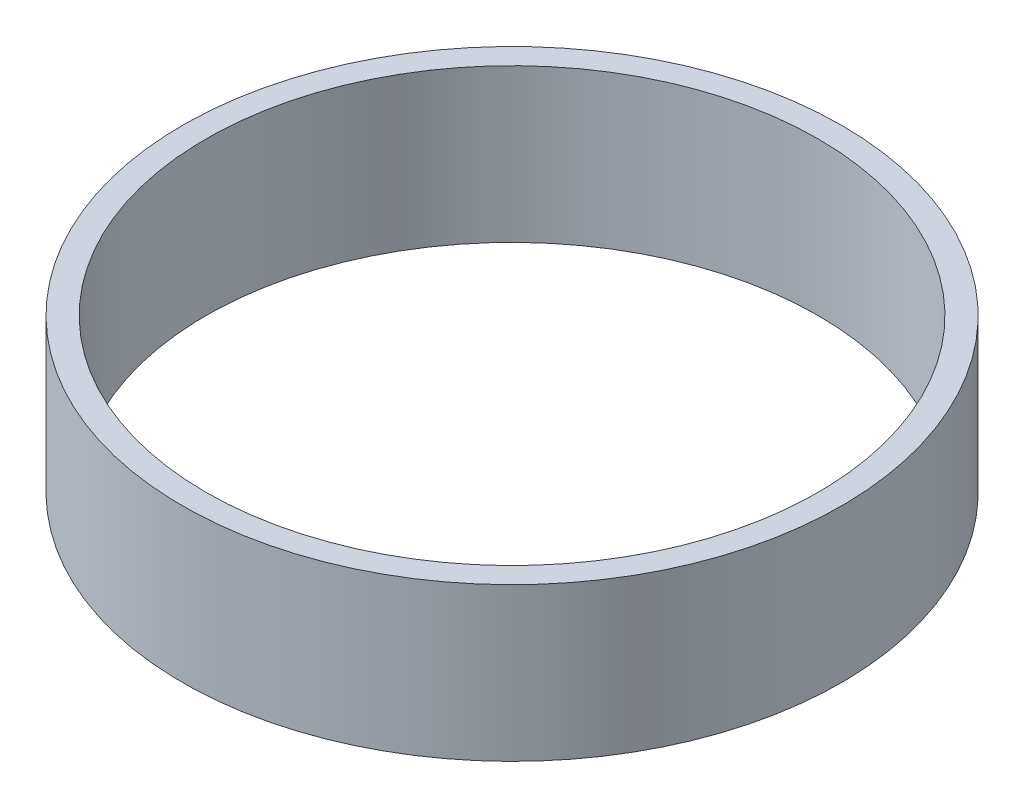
ISO-10303-21;
HEADER;
FILE_DESCRIPTION(('STEP AP214'),'2;1');
FILE_NAME('part.step','',(''),(''),'','','');
FILE_SCHEMA(('AUTOMOTIVE_DESIGN { 1 0 10303 214 1 1 1 1 }'));
ENDSEC;
DATA;
#1=APPLICATION_CONTEXT('core data for automotive mechanical design processes');
#2=APPLICATION_PROTOCOL_DEFINITION('international standard','automotive_design',2000,#1);
#3=PRODUCT_CONTEXT('',#1,'mechanical');
#4=PRODUCT('Part','Part','',(#3));
#5=PRODUCT_RELATED_PRODUCT_CATEGORY('part','',(#4));
#6=PRODUCT_DEFINITION_FORMATION('','',#4);
#7=PRODUCT_DEFINITION_CONTEXT('part definition',#1,'design');
#8=PRODUCT_DEFINITION('design','',#6,#7);
#9=PRODUCT_DEFINITION_SHAPE('','',#8);
#10=(LENGTH_UNIT() NAMED_UNIT(*) SI_UNIT(.MILLI.,.METRE.));
#11=(NAMED_UNIT(*) PLANE_ANGLE_UNIT() SI_UNIT($,.RADIAN.));
#12=(NAMED_UNIT(*) SI_UNIT($,.STERADIAN.) SOLID_ANGLE_UNIT());
#13=UNCERTAINTY_MEASURE_WITH_UNIT(LENGTH_MEASURE(1.E-05),#10,'distance_accuracy_value','');
#14=(GEOMETRIC_REPRESENTATION_CONTEXT(3) GLOBAL_UNCERTAINTY_ASSIGNED_CONTEXT((#13)) GLOBAL_UNIT_ASSIGNED_CONTEXT((#10,
#11,#12)) REPRESENTATION_CONTEXT('',''));
#15=CARTESIAN_POINT('',(0.,0.,0.));
#16=DIRECTION('',(0.,0.,1.));
#17=DIRECTION('',(1.,0.,0.));
#18=AXIS2_PLACEMENT_3D('',#15,#16,#17);
#19=CARTESIAN_POINT('',(0.,9.525,0.));
#20=DIRECTION('',(0.,1.,0.));
#21=DIRECTION('',(0.,0.,1.));
#22=AXIS2_PLACEMENT_3D('',#19,#20,#21);
#23=PLANE('',#22);
#24=CARTESIAN_POINT('',(0.,9.525,0.));
#25=DIRECTION('',(0.,1.,0.));
#26=DIRECTION('',(0.,0.,1.));
#27=AXIS2_PLACEMENT_3D('',#24,#25,#26);
#28=CIRCLE('',#27,20.5105);
#29=CARTESIAN_POINT('',(0.,9.525,-20.5105));
#30=VERTEX_POINT('',#29);
#31=EDGE_CURVE('E10',#30,#30,#28,.T.);
#32=ORIENTED_EDGE('',*,*,#31,.T.);
#33=EDGE_LOOP('',(#32));
#34=FACE_BOUND('',#33,.T.);
#35=CARTESIAN_POINT('',(0.,9.525,0.));
#36=DIRECTION('',(0.,1.,0.));
#37=DIRECTION('',(0.,0.,1.));
#38=AXIS2_PLACEMENT_3D('',#35,#36,#37);
#39=CIRCLE('',#38,19.05);
#40=CARTESIAN_POINT('',(0.,9.525,-19.05));
#41=VERTEX_POINT('',#40);
#42=EDGE_CURVE('E41',#41,#41,#39,.T.);
#43=ORIENTED_EDGE('',*,*,#42,.F.);
#44=EDGE_LOOP('',(#43));
#45=FACE_BOUND('',#44,.T.);
#46=ADVANCED_FACE('F30',(#34,#45),#23,.T.);
#47=CARTESIAN_POINT('',(0.,0.,0.));
#48=DIRECTION('',(0.,1.,0.));
#49=DIRECTION('',(0.,0.,1.));
#50=AXIS2_PLACEMENT_3D('',#47,#48,#49);
#51=PLANE('',#50);
#52=CARTESIAN_POINT('',(0.,0.,0.));
#53=DIRECTION('',(0.,1.,0.));
#54=DIRECTION('',(0.,0.,1.));
#55=AXIS2_PLACEMENT_3D('',#52,#53,#54);
#56=CIRCLE('',#55,20.5105);
#57=CARTESIAN_POINT('',(0.,0.,-20.5105));
#58=VERTEX_POINT('',#57);
#59=EDGE_CURVE('E34',#58,#58,#56,.T.);
#60=ORIENTED_EDGE('',*,*,#59,.F.);
#61=EDGE_LOOP('',(#60));
#62=FACE_BOUND('',#61,.T.);
#63=CARTESIAN_POINT('',(0.,0.,0.));
#64=DIRECTION('',(0.,1.,0.));
#65=DIRECTION('',(0.,0.,1.));
#66=AXIS2_PLACEMENT_3D('',#63,#64,#65);
#67=CIRCLE('',#66,19.05);
#68=CARTESIAN_POINT('',(0.,0.,-19.05));
#69=VERTEX_POINT('',#68);
#70=EDGE_CURVE('E43',#69,#69,#67,.T.);
#71=ORIENTED_EDGE('',*,*,#70,.T.);
#72=EDGE_LOOP('',(#71));
#73=FACE_BOUND('',#72,.T.);
#74=ADVANCED_FACE('F53',(#62,#73),#51,.F.);
#75=CARTESIAN_POINT('',(0.,9.525,0.));
#76=DIRECTION('',(0.,-1.,0.));
#77=DIRECTION('',(0.,0.,-1.));
#78=AXIS2_PLACEMENT_3D('',#75,#76,#77);
#79=CYLINDRICAL_SURFACE('',#78,20.5105);
#80=CARTESIAN_POINT('',(0.,9.525,-20.5105));
#81=CARTESIAN_POINT('',(0.,9.42578125,-20.5105));
#82=CARTESIAN_POINT('',(0.,9.3265625,-20.5105));
#83=CARTESIAN_POINT('',(0.,9.128125,-20.5105));
#84=CARTESIAN_POINT('',(0.,9.02890625,-20.5105));
#85=CARTESIAN_POINT('',(0.,8.83046875,-20.5105));
#86=CARTESIAN_POINT('',(0.,8.73125,-20.5105));
#87=CARTESIAN_POINT('',(0.,8.5328125,-20.5105));
#88=CARTESIAN_POINT('',(0.,8.43359375,-20.5105));
#89=CARTESIAN_POINT('',(0.,8.23515625,-20.5105));
#90=CARTESIAN_POINT('',(0.,8.1359375,-20.5105));
#91=CARTESIAN_POINT('',(0.,7.9375,-20.5105));
#92=CARTESIAN_POINT('',(0.,7.83828125,-20.5105));
#93=CARTESIAN_POINT('',(0.,7.63984375,-20.5105));
#94=CARTESIAN_POINT('',(0.,7.540625,-20.5105));
#95=CARTESIAN_POINT('',(0.,7.3421875,-20.5105));
#96=CARTESIAN_POINT('',(0.,7.24296875,-20.5105));
#97=CARTESIAN_POINT('',(0.,7.04453125,-20.5105));
#98=CARTESIAN_POINT('',(0.,6.9453125,-20.5105));
#99=CARTESIAN_POINT('',(0.,6.746875,-20.5105));
#100=CARTESIAN_POINT('',(0.,6.64765625,-20.5105));
#101=CARTESIAN_POINT('',(0.,6.44921875,-20.5105));
#102=CARTESIAN_POINT('',(0.,6.35,-20.5105));
#103=CARTESIAN_POINT('',(0.,6.1515625,-20.5105));
#104=CARTESIAN_POINT('',(0.,6.05234375,-20.5105));
#105=CARTESIAN_POINT('',(0.,5.85390625,-20.5105));
#106=CARTESIAN_POINT('',(0.,5.7546875,-20.5105));
#107=CARTESIAN_POINT('',(0.,5.55625,-20.5105));
#108=CARTESIAN_POINT('',(0.,5.45703125,-20.5105));
#109=CARTESIAN_POINT('',(0.,5.25859375,-20.5105));
#110=CARTESIAN_POINT('',(0.,5.159375,-20.5105));
#111=CARTESIAN_POINT('',(0.,4.9609375,-20.5105));
#112=CARTESIAN_POINT('',(0.,4.86171875,-20.5105));
#113=CARTESIAN_POINT('',(0.,4.66328125,-20.5105));
#114=CARTESIAN_POINT('',(0.,4.5640625,-20.5105));
#115=CARTESIAN_POINT('',(0.,4.365625,-20.5105));
#116=CARTESIAN_POINT('',(0.,4.26640625,-20.5105));
#117=CARTESIAN_POINT('',(0.,4.06796875,-20.5105));
#118=CARTESIAN_POINT('',(0.,3.96875,-20.5105));
#119=CARTESIAN_POINT('',(0.,3.7703125,-20.5105));
#120=CARTESIAN_POINT('',(0.,3.67109375,-20.5105));
#121=CARTESIAN_POINT('',(0.,3.47265625,-20.5105));
#122=CARTESIAN_POINT('',(0.,3.3734375,-20.5105));
#123=CARTESIAN_POINT('',(0.,3.175,-20.5105));
#124=CARTESIAN_POINT('',(0.,3.07578125,-20.5105));
#125=CARTESIAN_POINT('',(0.,2.87734375,-20.5105));
#126=CARTESIAN_POINT('',(0.,2.778125,-20.5105));
#127=CARTESIAN_POINT('',(0.,2.5796875,-20.5105));
#128=CARTESIAN_POINT('',(0.,2.48046875,-20.5105));
#129=CARTESIAN_POINT('',(0.,2.28203125,-20.5105));
#130=CARTESIAN_POINT('',(0.,2.1828125,-20.5105));
#131=CARTESIAN_POINT('',(0.,1.984375,-20.5105));
#132=CARTESIAN_POINT('',(0.,1.88515625,-20.5105));
#133=CARTESIAN_POINT('',(0.,1.68671875,-20.5105));
#134=CARTESIAN_POINT('',(0.,1.5875,-20.5105));
#135=CARTESIAN_POINT('',(0.,1.3890625,-20.5105));
#136=CARTESIAN_POINT('',(0.,1.28984375,-20.5105));
#137=CARTESIAN_POINT('',(0.,1.09140625,-20.5105));
#138=CARTESIAN_POINT('',(0.,0.992187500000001,-20.5105));
#139=CARTESIAN_POINT('',(0.,0.793750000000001,-20.5105));
#140=CARTESIAN_POINT('',(0.,0.69453125,-20.5105));
#141=CARTESIAN_POINT('',(0.,0.49609375,-20.5105));
#142=CARTESIAN_POINT('',(0.,0.396875,-20.5105));
#143=CARTESIAN_POINT('',(0.,0.1984375,-20.5105));
#144=CARTESIAN_POINT('',(0.,0.0992187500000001,-20.5105));
#145=CARTESIAN_POINT('',(0.,0.,-20.5105));
#146=B_SPLINE_CURVE_WITH_KNOTS('',3,(#80,#81,#82,#83,#84,#85,#86,#87,#88,#89,#90,#91,#92,#93,
#94,#95,#96,#97,#98,#99,#100,#101,#102,#103,#104,#105,#106,#107,#108,#109,#110,#111,#112,#113,
#114,#115,#116,#117,#118,#119,#120,#121,#122,#123,#124,#125,#126,#127,#128,#129,#130,#131,#132,
#133,#134,#135,#136,#137,#138,#139,#140,#141,#142,#143,#144,#145),.UNSPECIFIED.,.F.,.F.,(4,2,2,
2,2,2,2,2,2,2,2,2,2,2,2,2,2,2,2,2,2,2,2,2,2,2,2,2,2,2,2,2,4),(0.,0.29765625,0.5953125,
0.892968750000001,1.190625,1.48828125,1.7859375,2.08359375,2.38125,2.67890625,2.9765625,
3.27421875,3.571875,3.86953125,4.1671875,4.46484375,4.7625,5.06015625,5.3578125,5.65546875,
5.953125,6.25078125,6.5484375,6.84609375,7.14375,7.44140625,7.7390625,8.03671875,8.334375,
8.63203125,8.9296875,9.22734375,9.525),.UNSPECIFIED.);
#147=EDGE_CURVE('BSEAM32',#30,#58,#146,.T.);
#148=ORIENTED_EDGE('',*,*,#31,.F.);
#149=ORIENTED_EDGE('',*,*,#59,.T.);
#150=ORIENTED_EDGE('',*,*,#147,.T.);
#151=ORIENTED_EDGE('',*,*,#147,.F.);
#152=EDGE_LOOP('',(#148,#150,#149,#151));
#153=FACE_BOUND('',#152,.T.);
#154=ADVANCED_FACE('F32',(#153),#79,.T.);
#155=CARTESIAN_POINT('',(0.,9.525,0.));
#156=DIRECTION('',(0.,-1.,0.));
#157=DIRECTION('',(0.,0.,-1.));
#158=AXIS2_PLACEMENT_3D('',#155,#156,#157);
#159=CYLINDRICAL_SURFACE('',#158,19.05);
#160=CARTESIAN_POINT('',(0.,9.525,-19.05));
#161=CARTESIAN_POINT('',(0.,9.42578125,-19.05));
#162=CARTESIAN_POINT('',(0.,9.3265625,-19.05));
#163=CARTESIAN_POINT('',(0.,9.128125,-19.05));
#164=CARTESIAN_POINT('',(0.,9.02890625,-19.05));
#165=CARTESIAN_POINT('',(0.,8.83046875,-19.05));
#166=CARTESIAN_POINT('',(0.,8.73125,-19.05));
#167=CARTESIAN_POINT('',(0.,8.5328125,-19.05));
#168=CARTESIAN_POINT('',(0.,8.43359375,-19.05));
#169=CARTESIAN_POINT('',(0.,8.23515625,-19.05));
#170=CARTESIAN_POINT('',(0.,8.1359375,-19.05));
#171=CARTESIAN_POINT('',(0.,7.9375,-19.05));
#172=CARTESIAN_POINT('',(0.,7.83828125,-19.05));
#173=CARTESIAN_POINT('',(0.,7.63984375,-19.05));
#174=CARTESIAN_POINT('',(0.,7.540625,-19.05));
#175=CARTESIAN_POINT('',(0.,7.3421875,-19.05));
#176=CARTESIAN_POINT('',(0.,7.24296875,-19.05));
#177=CARTESIAN_POINT('',(0.,7.04453125,-19.05));
#178=CARTESIAN_POINT('',(0.,6.9453125,-19.05));
#179=CARTESIAN_POINT('',(0.,6.746875,-19.05));
#180=CARTESIAN_POINT('',(0.,6.64765625,-19.05));
#181=CARTESIAN_POINT('',(0.,6.44921875,-19.05));
#182=CARTESIAN_POINT('',(0.,6.35,-19.05));
#183=CARTESIAN_POINT('',(0.,6.1515625,-19.05));
#184=CARTESIAN_POINT('',(0.,6.05234375,-19.05));
#185=CARTESIAN_POINT('',(0.,5.85390625,-19.05));
#186=CARTESIAN_POINT('',(0.,5.7546875,-19.05));
#187=CARTESIAN_POINT('',(0.,5.55625,-19.05));
#188=CARTESIAN_POINT('',(0.,5.45703125,-19.05));
#189=CARTESIAN_POINT('',(0.,5.25859375,-19.05));
#190=CARTESIAN_POINT('',(0.,5.159375,-19.05));
#191=CARTESIAN_POINT('',(0.,4.9609375,-19.05));
#192=CARTESIAN_POINT('',(0.,4.86171875,-19.05));
#193=CARTESIAN_POINT('',(0.,4.66328125,-19.05));
#194=CARTESIAN_POINT('',(0.,4.5640625,-19.05));
#195=CARTESIAN_POINT('',(0.,4.365625,-19.05));
#196=CARTESIAN_POINT('',(0.,4.26640625,-19.05));
#197=CARTESIAN_POINT('',(0.,4.06796875,-19.05));
#198=CARTESIAN_POINT('',(0.,3.96875,-19.05));
#199=CARTESIAN_POINT('',(0.,3.7703125,-19.05));
#200=CARTESIAN_POINT('',(0.,3.67109375,-19.05));
#201=CARTESIAN_POINT('',(0.,3.47265625,-19.05));
#202=CARTESIAN_POINT('',(0.,3.3734375,-19.05));
#203=CARTESIAN_POINT('',(0.,3.175,-19.05));
#204=CARTESIAN_POINT('',(0.,3.07578125,-19.05));
#205=CARTESIAN_POINT('',(0.,2.87734375,-19.05));
#206=CARTESIAN_POINT('',(0.,2.778125,-19.05));
#207=CARTESIAN_POINT('',(0.,2.5796875,-19.05));
#208=CARTESIAN_POINT('',(0.,2.48046875,-19.05));
#209=CARTESIAN_POINT('',(0.,2.28203125,-19.05));
#210=CARTESIAN_POINT('',(0.,2.1828125,-19.05));
#211=CARTESIAN_POINT('',(0.,1.984375,-19.05));
#212=CARTESIAN_POINT('',(0.,1.88515625,-19.05));
#213=CARTESIAN_POINT('',(0.,1.68671875,-19.05));
#214=CARTESIAN_POINT('',(0.,1.5875,-19.05));
#215=CARTESIAN_POINT('',(0.,1.3890625,-19.05));
#216=CARTESIAN_POINT('',(0.,1.28984375,-19.05));
#217=CARTESIAN_POINT('',(0.,1.09140625,-19.05));
#218=CARTESIAN_POINT('',(0.,0.992187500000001,-19.05));
#219=CARTESIAN_POINT('',(0.,0.793750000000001,-19.05));
#220=CARTESIAN_POINT('',(0.,0.69453125,-19.05));
#221=CARTESIAN_POINT('',(0.,0.49609375,-19.05));
#222=CARTESIAN_POINT('',(0.,0.396875,-19.05));
#223=CARTESIAN_POINT('',(0.,0.1984375,-19.05));
#224=CARTESIAN_POINT('',(0.,0.0992187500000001,-19.05));
#225=CARTESIAN_POINT('',(0.,0.,-19.05));
#226=B_SPLINE_CURVE_WITH_KNOTS('',3,(#160,#161,#162,#163,#164,#165,#166,#167,#168,#169,#170,
#171,#172,#173,#174,#175,#176,#177,#178,#179,#180,#181,#182,#183,#184,#185,#186,#187,#188,#189,
#190,#191,#192,#193,#194,#195,#196,#197,#198,#199,#200,#201,#202,#203,#204,#205,#206,#207,#208,
#209,#210,#211,#212,#213,#214,#215,#216,#217,#218,#219,#220,#221,#222,#223,#224,#225),
.UNSPECIFIED.,.F.,.F.,(4,2,2,2,2,2,2,2,2,2,2,2,2,2,2,2,2,2,2,2,2,2,2,2,2,2,2,2,2,2,2,2,4),(0.,
0.29765625,0.5953125,0.892968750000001,1.190625,1.48828125,1.7859375,2.08359375,2.38125,
2.67890625,2.9765625,3.27421875,3.571875,3.86953125,4.1671875,4.46484375,4.7625,5.06015625,
5.3578125,5.65546875,5.953125,6.25078125,6.5484375,6.84609375,7.14375,7.44140625,7.7390625,
8.03671875,8.334375,8.63203125,8.9296875,9.22734375,9.525),.UNSPECIFIED.);
#227=EDGE_CURVE('BSEAM49',#41,#69,#226,.T.);
#228=ORIENTED_EDGE('',*,*,#42,.T.);
#229=ORIENTED_EDGE('',*,*,#70,.F.);
#230=ORIENTED_EDGE('',*,*,#227,.T.);
#231=ORIENTED_EDGE('',*,*,#227,.F.);
#232=EDGE_LOOP('',(#228,#230,#229,#231));
#233=FACE_BOUND('',#232,.T.);
#234=ADVANCED_FACE('F49',(#233),#159,.F.);
#235=CLOSED_SHELL('',(#46,#74,#154,#234));
#236=MANIFOLD_SOLID_BREP('B2',#235);
#237=ADVANCED_BREP_SHAPE_REPRESENTATION('',(#18,#236),#14);
#238=SHAPE_DEFINITION_REPRESENTATION(#9,#237);
ENDSEC;
END-ISO-10303-21;
